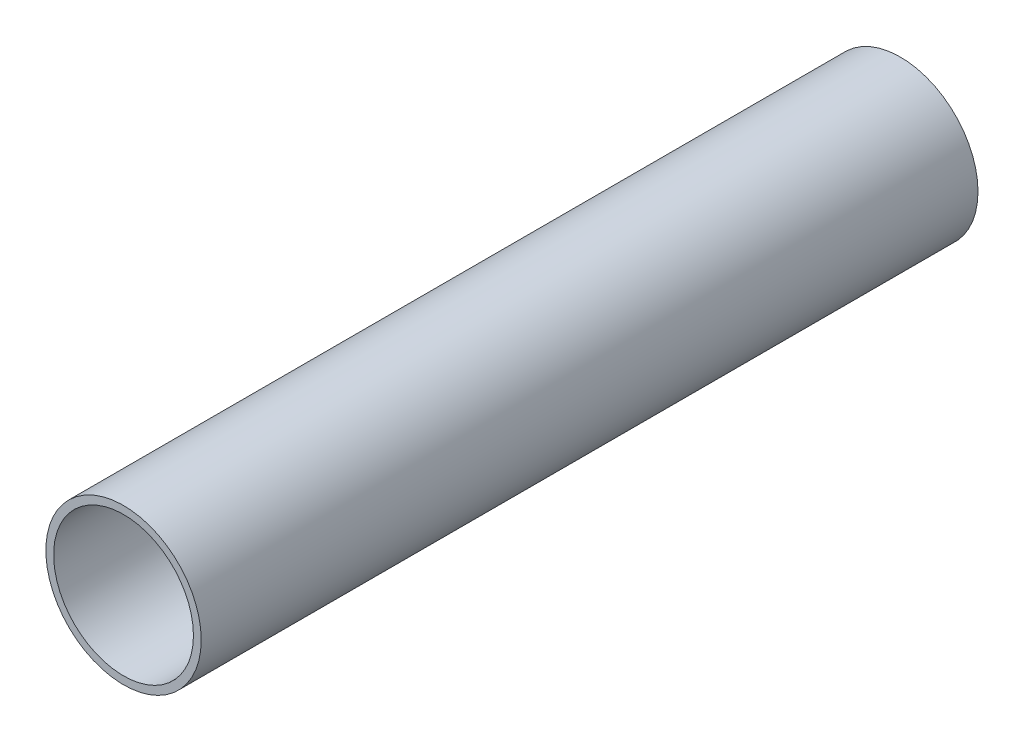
from build123d import *

# Parameters (mm, degrees)
ESQUISSE1_R        = 15
ESQUISSE1_R_2      = 13.5
EXTRU_MINCE1_DEPTH = 150


with BuildPart() as part:
    # Esquisse1 → Extru.-Mince1 (new body)
    with BuildSketch(Plane.XY):
        Circle(ESQUISSE1_R)
        Circle(ESQUISSE1_R_2, mode=Mode.SUBTRACT)
    extrude(amount=EXTRU_MINCE1_DEPTH)


solid = part.part
